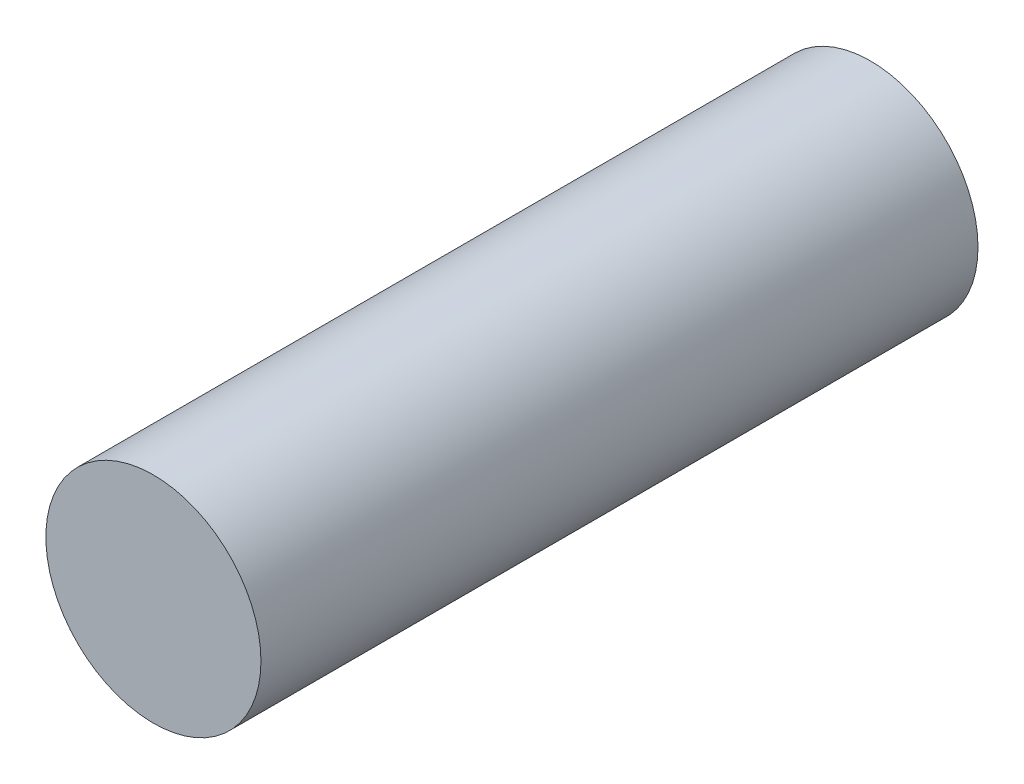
from build123d import *

# Parameters (mm, degrees)
SKETCH1_R           = 30
BOSS_EXTRUDE1_DEPTH = 200


with BuildPart() as part:
    # Sketch1 → Boss-Extrude1 (new body)
    with BuildSketch(Plane.XY):
        Circle(SKETCH1_R)
    extrude(amount=-BOSS_EXTRUDE1_DEPTH)


solid = part.part
